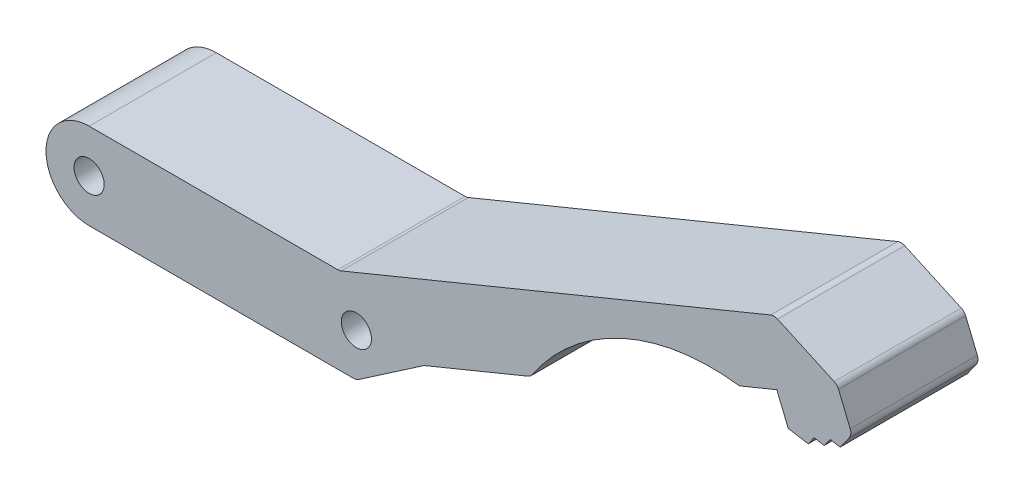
from build123d import *

# Parameters (mm, degrees)
SKETCH_1_R      = 1.75
EXTRUDE_1_DEPTH = 7.375
FILLET_1_R      = 1


with BuildPart() as part:
    # Sketch 1 → Extrude 1 (new, symmetric)
    # profile 1 of 2: a face of its own
    with BuildSketch(Plane.XY):
        with BuildLine():
            Line((20.05, 5), (-9, 5))
            ThreePointArc((-9, 5), (-14, 0), (-9, -5))
            Line((-9, -5), (22, -5))
            Line((22, -5), (29.853914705, 0.381089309))
            Line((29.853914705, 0.381089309), (42.223162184, 5.466701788))
            ThreePointArc((42.223162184, 5.466701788), (52.710898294, 14.550781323), (66.42982236, 16.625445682))
            Line((66.42982236, 16.625445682), (70.761563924, 18.406439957))
            Line((70.761563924, 18.406439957), (72.085078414, 15.187382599))
            Line((72.085078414, 15.187382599), (73.247621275, 14.989597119))
            Line((73.247621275, 14.989597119), (74.410164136, 14.791811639))
            Line((74.410164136, 14.791811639), (75.097377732, 15.750123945))
            Line((75.097377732, 15.750123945), (76.259920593, 15.552338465))
            Line((76.259920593, 15.552338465), (76.947134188, 16.51065077))
            Line((76.947134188, 16.51065077), (78.109677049, 16.31286529))
            Line((78.109677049, 16.31286529), (78.796890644, 17.271177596))
            Line((78.796890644, 17.271177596), (79.484104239, 18.229489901))
            Line((79.484104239, 18.229489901), (77.772918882, 22.391441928))
            Line((77.772918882, 22.391441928), (70.455863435, 25.724355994))
            Line((70.455863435, 25.724355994), (20.05, 5))
        make_face()
        with Locations((-9, 0)):
            Circle(SKETCH_1_R, mode=Mode.SUBTRACT)
        with Locations((22, 0)):
            Circle(SKETCH_1_R, mode=Mode.SUBTRACT)
    # profile 2 of 2: a face of its own
    with BuildSketch(Plane.XY):
        with BuildLine():
            Line((20.05, 5), (-9, 5))
            ThreePointArc((-9, 5), (-14, 0), (-9, -5))
            Line((-9, -5), (22, -5))
            Line((22, -5), (29.853914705, 0.381089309))
            Line((29.853914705, 0.381089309), (42.223162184, 5.466701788))
            ThreePointArc((42.223162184, 5.466701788), (52.710898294, 14.550781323), (66.42982236, 16.625445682))
            Line((66.42982236, 16.625445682), (70.761563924, 18.406439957))
            Line((70.761563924, 18.406439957), (72.085078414, 15.187382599))
            Line((72.085078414, 15.187382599), (73.247621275, 14.989597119))
            Line((73.247621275, 14.989597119), (74.410164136, 14.791811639))
            Line((74.410164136, 14.791811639), (75.097377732, 15.750123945))
            Line((75.097377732, 15.750123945), (76.259920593, 15.552338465))
            Line((76.259920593, 15.552338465), (76.947134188, 16.51065077))
            Line((76.947134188, 16.51065077), (78.109677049, 16.31286529))
            Line((78.109677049, 16.31286529), (78.796890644, 17.271177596))
            Line((78.796890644, 17.271177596), (79.484104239, 18.229489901))
            Line((79.484104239, 18.229489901), (77.772918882, 22.391441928))
            Line((77.772918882, 22.391441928), (70.455863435, 25.724355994))
            Line((70.455863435, 25.724355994), (20.05, 5))
        make_face()
        with Locations((-9, 0)):
            Circle(SKETCH_1_R, mode=Mode.SUBTRACT)
        with Locations((22, 0)):
            Circle(SKETCH_1_R, mode=Mode.SUBTRACT)
    extrude(amount=EXTRUDE_1_DEPTH, both=True)

    # Fillet 1
    fillet_1_edges = [part.edges().sort_by_distance(p)[0] for p in [
        (29.853914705, 0.381089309, 0),
        (22, -5, 0),
        (20.05, 5, 0),
        (70.455863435, 25.724355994, 0),
        (77.772918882, 22.391441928, 0),
        (79.484104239, 18.229489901, 0),
        (42.223162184, 5.466701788, 0),
    ]]
    fillet(fillet_1_edges, radius=FILLET_1_R)


solid = part.part
